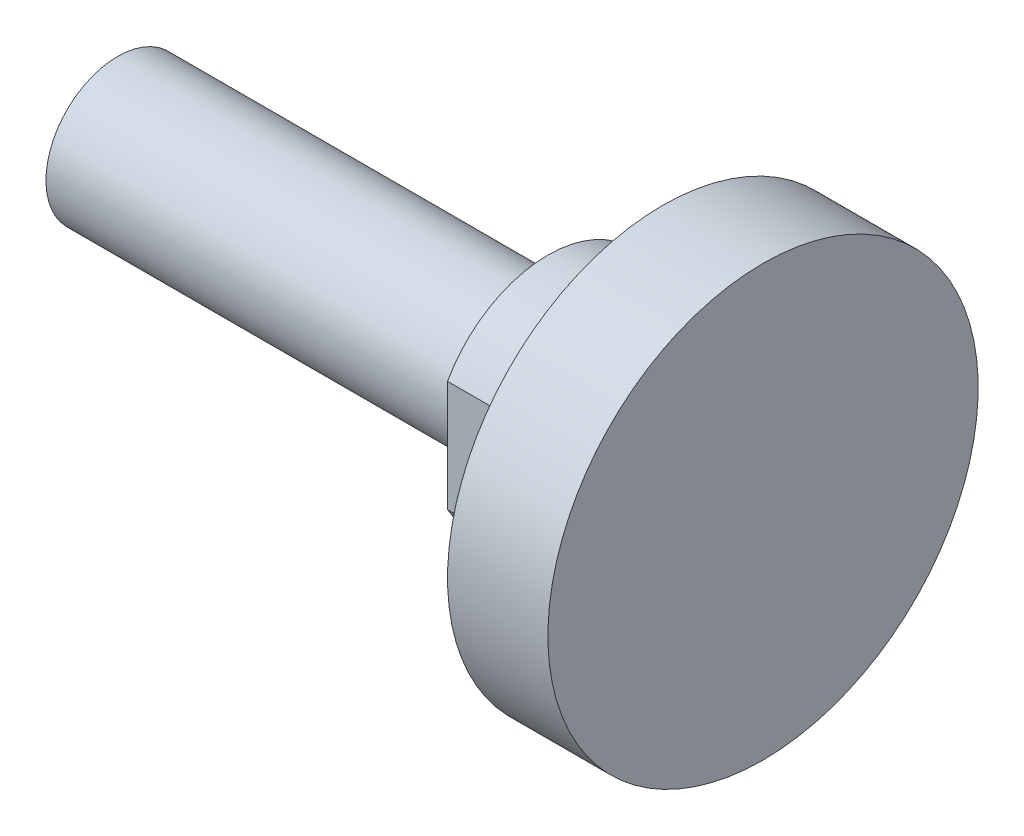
ISO-10303-21;
HEADER;
FILE_DESCRIPTION(('STEP AP214'),'2;1');
FILE_NAME('part.step','',(''),(''),'','','');
FILE_SCHEMA(('AUTOMOTIVE_DESIGN { 1 0 10303 214 1 1 1 1 }'));
ENDSEC;
DATA;
#1=APPLICATION_CONTEXT('core data for automotive mechanical design processes');
#2=APPLICATION_PROTOCOL_DEFINITION('international standard','automotive_design',2000,#1);
#3=PRODUCT_CONTEXT('',#1,'mechanical');
#4=PRODUCT('Part','Part','',(#3));
#5=PRODUCT_RELATED_PRODUCT_CATEGORY('part','',(#4));
#6=PRODUCT_DEFINITION_FORMATION('','',#4);
#7=PRODUCT_DEFINITION_CONTEXT('part definition',#1,'design');
#8=PRODUCT_DEFINITION('design','',#6,#7);
#9=PRODUCT_DEFINITION_SHAPE('','',#8);
#10=(LENGTH_UNIT() NAMED_UNIT(*) SI_UNIT(.MILLI.,.METRE.));
#11=(NAMED_UNIT(*) PLANE_ANGLE_UNIT() SI_UNIT($,.RADIAN.));
#12=(NAMED_UNIT(*) SI_UNIT($,.STERADIAN.) SOLID_ANGLE_UNIT());
#13=UNCERTAINTY_MEASURE_WITH_UNIT(LENGTH_MEASURE(1.E-05),#10,'distance_accuracy_value','');
#14=(GEOMETRIC_REPRESENTATION_CONTEXT(3) GLOBAL_UNCERTAINTY_ASSIGNED_CONTEXT((#13)) GLOBAL_UNIT_ASSIGNED_CONTEXT((#10,
#11,#12)) REPRESENTATION_CONTEXT('',''));
#15=CARTESIAN_POINT('',(0.,0.,0.));
#16=DIRECTION('',(0.,0.,1.));
#17=DIRECTION('',(1.,0.,0.));
#18=AXIS2_PLACEMENT_3D('',#15,#16,#17);
#19=CARTESIAN_POINT('',(45.,-4.99999999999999,0.));
#20=DIRECTION('',(1.,0.,0.));
#21=DIRECTION('',(0.,1.,0.));
#22=AXIS2_PLACEMENT_3D('',#19,#20,#21);
#23=CYLINDRICAL_SURFACE('',#22,8.);
#24=DIRECTION('',(1.,0.,0.));
#25=VECTOR('',#24,1.);
#26=CARTESIAN_POINT('',(45.,-1.12701665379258,7.));
#27=LINE('',#26,#25);
#28=CARTESIAN_POINT('',(38.,-1.12701665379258,7.));
#29=VERTEX_POINT('',#28);
#30=CARTESIAN_POINT('',(30.,-1.12701665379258,7.));
#31=VERTEX_POINT('',#30);
#32=EDGE_CURVE('E74',#29,#31,#27,.F.);
#33=ORIENTED_EDGE('',*,*,#32,.F.);
#34=CARTESIAN_POINT('',(38.,-5.,0.));
#35=DIRECTION('',(1.,0.,0.));
#36=DIRECTION('',(0.,1.,0.));
#37=AXIS2_PLACEMENT_3D('',#34,#35,#36);
#38=CIRCLE('',#37,8.);
#39=CARTESIAN_POINT('',(38.,-1.12701665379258,-7.));
#40=VERTEX_POINT('',#39);
#41=EDGE_CURVE('E98',#40,#29,#38,.T.);
#42=ORIENTED_EDGE('',*,*,#41,.F.);
#43=DIRECTION('',(1.,0.,0.));
#44=VECTOR('',#43,1.);
#45=CARTESIAN_POINT('',(45.,-1.12701665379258,-7.));
#46=LINE('',#45,#44);
#47=CARTESIAN_POINT('',(30.,-1.12701665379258,-7.));
#48=VERTEX_POINT('',#47);
#49=EDGE_CURVE('E95',#48,#40,#46,.T.);
#50=ORIENTED_EDGE('',*,*,#49,.F.);
#51=CARTESIAN_POINT('',(30.,-5.,0.));
#52=DIRECTION('',(1.,0.,0.));
#53=DIRECTION('',(0.,1.,0.));
#54=AXIS2_PLACEMENT_3D('',#51,#52,#53);
#55=CIRCLE('',#54,8.);
#56=EDGE_CURVE('E91',#48,#31,#55,.T.);
#57=ORIENTED_EDGE('',*,*,#56,.T.);
#58=EDGE_LOOP('',(#33,#42,#50,#57));
#59=FACE_BOUND('',#58,.T.);
#60=ADVANCED_FACE('F35',(#59),#23,.T.);
#61=CARTESIAN_POINT('',(0.,-5.,0.));
#62=DIRECTION('',(-1.,0.,0.));
#63=DIRECTION('',(0.,-1.,0.));
#64=AXIS2_PLACEMENT_3D('',#61,#62,#63);
#65=PLANE('',#64);
#66=CARTESIAN_POINT('',(0.,-5.,0.));
#67=DIRECTION('',(1.,0.,0.));
#68=DIRECTION('',(0.,1.,0.));
#69=AXIS2_PLACEMENT_3D('',#66,#67,#68);
#70=CIRCLE('',#69,5.);
#71=CARTESIAN_POINT('',(0.,0.,0.));
#72=VERTEX_POINT('',#71);
#73=EDGE_CURVE('E11',#72,#72,#70,.T.);
#74=ORIENTED_EDGE('',*,*,#73,.F.);
#75=EDGE_LOOP('',(#74));
#76=FACE_BOUND('',#75,.T.);
#77=ADVANCED_FACE('F37',(#76),#65,.T.);
#78=CARTESIAN_POINT('',(45.,-4.99999999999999,0.));
#79=DIRECTION('',(1.,0.,0.));
#80=DIRECTION('',(0.,1.,0.));
#81=AXIS2_PLACEMENT_3D('',#78,#79,#80);
#82=CYLINDRICAL_SURFACE('',#81,5.);
#83=ORIENTED_EDGE('',*,*,#73,.T.);
#84=EDGE_LOOP('',(#83));
#85=FACE_BOUND('',#84,.T.);
#86=CARTESIAN_POINT('',(30.,-5.,0.));
#87=DIRECTION('',(1.,0.,0.));
#88=DIRECTION('',(0.,1.,0.));
#89=AXIS2_PLACEMENT_3D('',#86,#87,#88);
#90=CIRCLE('',#89,5.);
#91=CARTESIAN_POINT('',(30.,0.,0.));
#92=VERTEX_POINT('',#91);
#93=EDGE_CURVE('E43',#92,#92,#90,.T.);
#94=ORIENTED_EDGE('',*,*,#93,.F.);
#95=EDGE_LOOP('',(#94));
#96=FACE_BOUND('',#95,.T.);
#97=ADVANCED_FACE('F139',(#85,#96),#82,.T.);
#98=CARTESIAN_POINT('',(30.,0.,0.));
#99=DIRECTION('',(-1.,0.,0.));
#100=DIRECTION('',(0.,-1.,0.));
#101=AXIS2_PLACEMENT_3D('',#98,#99,#100);
#102=PLANE('',#101);
#103=DIRECTION('',(0.,-1.,0.));
#104=VECTOR('',#103,1.);
#105=CARTESIAN_POINT('',(30.,2.66930723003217,7.));
#106=LINE('',#105,#104);
#107=CARTESIAN_POINT('',(30.,-8.87298334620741,7.));
#108=VERTEX_POINT('',#107);
#109=EDGE_CURVE('E77',#31,#108,#106,.T.);
#110=ORIENTED_EDGE('',*,*,#109,.F.);
#111=ORIENTED_EDGE('',*,*,#56,.F.);
#112=DIRECTION('',(0.,1.,0.));
#113=VECTOR('',#112,1.);
#114=CARTESIAN_POINT('',(30.,2.66930723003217,-7.));
#115=LINE('',#114,#113);
#116=CARTESIAN_POINT('',(30.,-8.87298334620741,-7.));
#117=VERTEX_POINT('',#116);
#118=EDGE_CURVE('E82',#117,#48,#115,.T.);
#119=ORIENTED_EDGE('',*,*,#118,.F.);
#120=EDGE_CURVE('E92',#108,#117,#55,.T.);
#121=ORIENTED_EDGE('',*,*,#120,.F.);
#122=EDGE_LOOP('',(#110,#111,#119,#121));
#123=FACE_BOUND('',#122,.T.);
#124=ORIENTED_EDGE('',*,*,#93,.T.);
#125=EDGE_LOOP('',(#124));
#126=FACE_BOUND('',#125,.T.);
#127=ADVANCED_FACE('F88',(#123,#126),#102,.T.);
#128=DIRECTION('',(1.,0.,0.));
#129=VECTOR('',#128,1.);
#130=CARTESIAN_POINT('',(45.,-8.87298334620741,7.));
#131=LINE('',#130,#129);
#132=CARTESIAN_POINT('',(38.,-8.87298334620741,7.));
#133=VERTEX_POINT('',#132);
#134=EDGE_CURVE('E83',#108,#133,#131,.T.);
#135=ORIENTED_EDGE('',*,*,#134,.F.);
#136=ORIENTED_EDGE('',*,*,#120,.T.);
#137=DIRECTION('',(1.,0.,0.));
#138=VECTOR('',#137,1.);
#139=CARTESIAN_POINT('',(45.,-8.87298334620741,-7.));
#140=LINE('',#139,#138);
#141=CARTESIAN_POINT('',(38.,-8.87298334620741,-7.));
#142=VERTEX_POINT('',#141);
#143=EDGE_CURVE('E108',#142,#117,#140,.F.);
#144=ORIENTED_EDGE('',*,*,#143,.F.);
#145=EDGE_CURVE('E101',#133,#142,#38,.T.);
#146=ORIENTED_EDGE('',*,*,#145,.F.);
#147=EDGE_LOOP('',(#135,#136,#144,#146));
#148=FACE_BOUND('',#147,.T.);
#149=ADVANCED_FACE('F118',(#148),#23,.T.);
#150=CARTESIAN_POINT('',(38.,3.,0.));
#151=DIRECTION('',(-1.,0.,0.));
#152=DIRECTION('',(0.,-1.,0.));
#153=AXIS2_PLACEMENT_3D('',#150,#151,#152);
#154=PLANE('',#153);
#155=ORIENTED_EDGE('',*,*,#41,.T.);
#156=DIRECTION('',(0.,-1.,0.));
#157=VECTOR('',#156,1.);
#158=CARTESIAN_POINT('',(38.,2.66930723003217,7.));
#159=LINE('',#158,#157);
#160=EDGE_CURVE('E50',#29,#133,#159,.T.);
#161=ORIENTED_EDGE('',*,*,#160,.T.);
#162=ORIENTED_EDGE('',*,*,#145,.T.);
#163=DIRECTION('',(0.,1.,0.));
#164=VECTOR('',#163,1.);
#165=CARTESIAN_POINT('',(38.,2.66930723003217,-7.));
#166=LINE('',#165,#164);
#167=EDGE_CURVE('E55',#142,#40,#166,.T.);
#168=ORIENTED_EDGE('',*,*,#167,.T.);
#169=EDGE_LOOP('',(#155,#161,#162,#168));
#170=FACE_BOUND('',#169,.T.);
#171=CARTESIAN_POINT('',(38.,-5.,0.));
#172=DIRECTION('',(1.,0.,0.));
#173=DIRECTION('',(0.,1.,0.));
#174=AXIS2_PLACEMENT_3D('',#171,#172,#173);
#175=CIRCLE('',#174,15.);
#176=CARTESIAN_POINT('',(38.,10.,0.));
#177=VERTEX_POINT('',#176);
#178=EDGE_CURVE('E102',#177,#177,#175,.T.);
#179=ORIENTED_EDGE('',*,*,#178,.F.);
#180=EDGE_LOOP('',(#179));
#181=FACE_BOUND('',#180,.T.);
#182=ADVANCED_FACE('F119',(#170,#181),#154,.T.);
#183=CARTESIAN_POINT('',(45.,-4.99999999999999,0.));
#184=DIRECTION('',(1.,0.,0.));
#185=DIRECTION('',(0.,1.,0.));
#186=AXIS2_PLACEMENT_3D('',#183,#184,#185);
#187=CYLINDRICAL_SURFACE('',#186,15.);
#188=ORIENTED_EDGE('',*,*,#178,.T.);
#189=EDGE_LOOP('',(#188));
#190=FACE_BOUND('',#189,.T.);
#191=CARTESIAN_POINT('',(45.,-4.99999999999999,0.));
#192=DIRECTION('',(1.,0.,0.));
#193=DIRECTION('',(0.,1.,0.));
#194=AXIS2_PLACEMENT_3D('',#191,#192,#193);
#195=CIRCLE('',#194,15.);
#196=CARTESIAN_POINT('',(45.,10.,0.));
#197=VERTEX_POINT('',#196);
#198=EDGE_CURVE('E105',#197,#197,#195,.T.);
#199=ORIENTED_EDGE('',*,*,#198,.F.);
#200=EDGE_LOOP('',(#199));
#201=FACE_BOUND('',#200,.T.);
#202=ADVANCED_FACE('F131',(#190,#201),#187,.T.);
#203=CARTESIAN_POINT('',(45.,10.,0.));
#204=DIRECTION('',(1.,0.,0.));
#205=DIRECTION('',(0.,1.,0.));
#206=AXIS2_PLACEMENT_3D('',#203,#204,#205);
#207=PLANE('',#206);
#208=ORIENTED_EDGE('',*,*,#198,.T.);
#209=EDGE_LOOP('',(#208));
#210=FACE_BOUND('',#209,.T.);
#211=ADVANCED_FACE('F124',(#210),#207,.T.);
#212=CARTESIAN_POINT('',(38.,2.66930723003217,-7.));
#213=DIRECTION('',(0.,0.,1.));
#214=DIRECTION('',(0.,-1.,0.));
#215=AXIS2_PLACEMENT_3D('',#212,#213,#214);
#216=PLANE('',#215);
#217=ORIENTED_EDGE('',*,*,#143,.T.);
#218=ORIENTED_EDGE('',*,*,#118,.T.);
#219=ORIENTED_EDGE('',*,*,#49,.T.);
#220=ORIENTED_EDGE('',*,*,#167,.F.);
#221=EDGE_LOOP('',(#217,#218,#219,#220));
#222=FACE_BOUND('',#221,.T.);
#223=ADVANCED_FACE('F122',(#222),#216,.F.);
#224=CARTESIAN_POINT('',(38.,2.66930723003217,7.));
#225=DIRECTION('',(0.,0.,-1.));
#226=DIRECTION('',(0.,1.,0.));
#227=AXIS2_PLACEMENT_3D('',#224,#225,#226);
#228=PLANE('',#227);
#229=ORIENTED_EDGE('',*,*,#32,.T.);
#230=ORIENTED_EDGE('',*,*,#109,.T.);
#231=ORIENTED_EDGE('',*,*,#134,.T.);
#232=ORIENTED_EDGE('',*,*,#160,.F.);
#233=EDGE_LOOP('',(#229,#230,#231,#232));
#234=FACE_BOUND('',#233,.T.);
#235=ADVANCED_FACE('F76',(#234),#228,.F.);
#236=CLOSED_SHELL('',(#60,#77,#97,#127,#149,#182,#202,#211,#223,#235));
#237=MANIFOLD_SOLID_BREP('B2',#236);
#238=ADVANCED_BREP_SHAPE_REPRESENTATION('',(#18,#237),#14);
#239=SHAPE_DEFINITION_REPRESENTATION(#9,#238);
ENDSEC;
END-ISO-10303-21;
